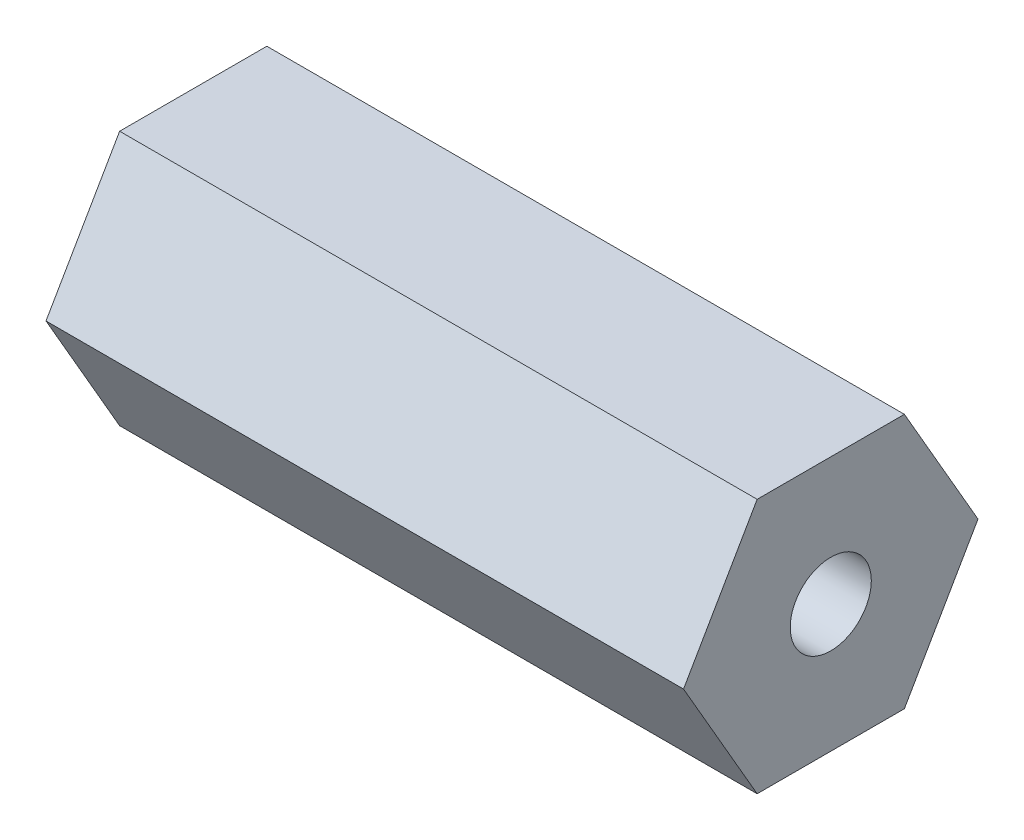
from build123d import *

# Parameters (mm, degrees)
BOSS_EXTRUDE1_DEPTH    = 31.75
F_10_32_TAPPED_HOLE1_D = 4.0386


with BuildPart() as part:
    # Sketch1 → Boss-Extrude1 (new body)
    with BuildSketch(Plane(origin=(0, 0, 0), x_dir=(0, 0, -1), z_dir=(1, 0, 0))):
        Polygon((7.332348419, 0), (3.666174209, 6.35), (-3.666174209, 6.35), (-7.332348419, 0), (-3.666174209, -6.35), (3.666174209, -6.35), align=None)
    extrude(amount=BOSS_EXTRUDE1_DEPTH)

    # 10-32 Tapped Hole1 (through all)
    with Locations(Plane(origin=(31.75, 0, 0), x_dir=(0, 0, 1), z_dir=(1, 0, 0))):
        with Locations((0, 0)):
            Hole(F_10_32_TAPPED_HOLE1_D / 2)


solid = part.part
